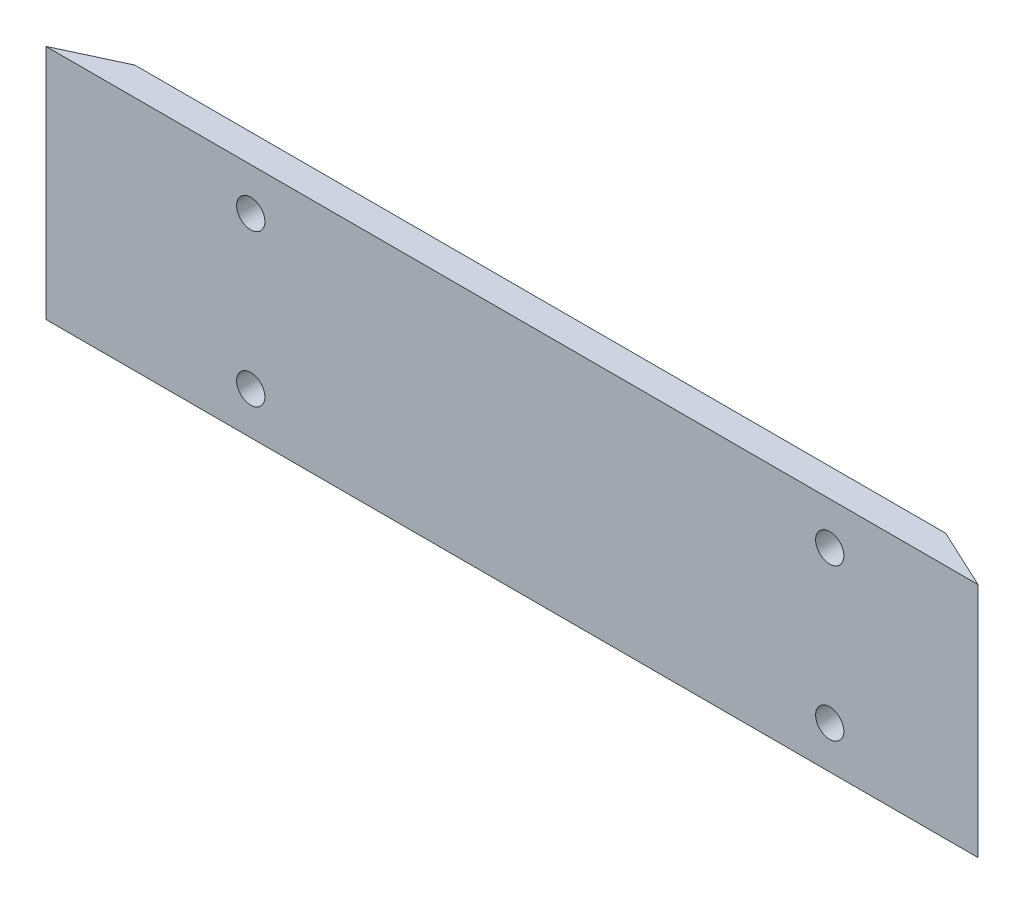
from build123d import *

# Parameters (mm, degrees)
EXTRUDE1_DEPTH     = 106.3625
SKETCH3_R          = 4.953
CUT_EXTRUDE2_DEPTH = 6.35
SKETCH4_R          = 12.7
CUT_EXTRUDE3_DEPTH = 458.445225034


with BuildPart() as part:
    # Sketch1 → Extrude1 (new, symmetric)
    with BuildSketch(Plane(origin=(0, 0, 0), x_dir=(1, 0, 0), z_dir=(0, 1, 0))):
        Polygon((-444.5, -12.7), (393.7, -12.7), (339.229524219, 12.7), (-390.029524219, 12.7), align=None)
    extrude(amount=EXTRUDE1_DEPTH, both=True)

    # Sketch3 → Cut-Extrude2 (cut)
    with BuildSketch(Plane(origin=(0, 0, -12.7), x_dir=(-1, 0, 0), z_dir=(0, 0, -1))):
        with Locations((260.35, 68.2625)):
            Circle(SKETCH3_R)
        with Locations((260.35, -68.2625)):
            Circle(SKETCH3_R)
    cut_extrude2 = extrude(amount=-CUT_EXTRUDE2_DEPTH, mode=Mode.SUBTRACT)

    # Sketch4 → Cut-Extrude3 (cut, through all)
    with BuildSketch(Plane(origin=(0, 0, -6.35), x_dir=(-1, 0, 0), z_dir=(0, 0, -1))):
        with Locations((260.35, -68.2625)):
            Circle(SKETCH4_R)
        with Locations((260.35, 68.2625)):
            Circle(SKETCH4_R)
    cut_extrude3 = extrude(amount=-CUT_EXTRUDE3_DEPTH, mode=Mode.SUBTRACT)

    # Mirror1: Cut-Extrude2, Cut-Extrude3 across plane
    add(cut_extrude2.mirror(Plane(origin=(0, 0, 0), x_dir=(0, 0, 1), z_dir=(1, 0, 0))), mode=Mode.SUBTRACT)
    add(cut_extrude3.mirror(Plane(origin=(0, 0, 0), x_dir=(0, 0, 1), z_dir=(1, 0, 0))), mode=Mode.SUBTRACT)


solid = part.part
